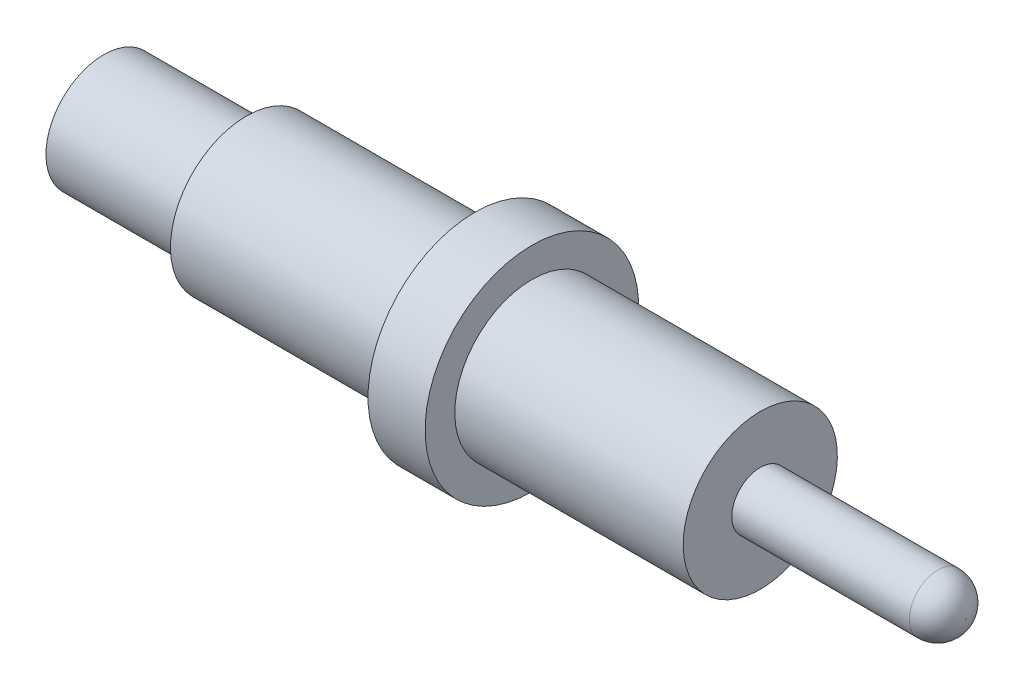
ISO-10303-21;
HEADER;
FILE_DESCRIPTION(('STEP AP214'),'2;1');
FILE_NAME('part.step','',(''),(''),'','','');
FILE_SCHEMA(('AUTOMOTIVE_DESIGN { 1 0 10303 214 1 1 1 1 }'));
ENDSEC;
DATA;
#1=APPLICATION_CONTEXT('core data for automotive mechanical design processes');
#2=APPLICATION_PROTOCOL_DEFINITION('international standard','automotive_design',2000,#1);
#3=PRODUCT_CONTEXT('',#1,'mechanical');
#4=PRODUCT('Part','Part','',(#3));
#5=PRODUCT_RELATED_PRODUCT_CATEGORY('part','',(#4));
#6=PRODUCT_DEFINITION_FORMATION('','',#4);
#7=PRODUCT_DEFINITION_CONTEXT('part definition',#1,'design');
#8=PRODUCT_DEFINITION('design','',#6,#7);
#9=PRODUCT_DEFINITION_SHAPE('','',#8);
#10=(LENGTH_UNIT() NAMED_UNIT(*) SI_UNIT(.MILLI.,.METRE.));
#11=(NAMED_UNIT(*) PLANE_ANGLE_UNIT() SI_UNIT($,.RADIAN.));
#12=(NAMED_UNIT(*) SI_UNIT($,.STERADIAN.) SOLID_ANGLE_UNIT());
#13=UNCERTAINTY_MEASURE_WITH_UNIT(LENGTH_MEASURE(1.E-05),#10,'distance_accuracy_value','');
#14=(GEOMETRIC_REPRESENTATION_CONTEXT(3) GLOBAL_UNCERTAINTY_ASSIGNED_CONTEXT((#13)) GLOBAL_UNIT_ASSIGNED_CONTEXT((#10,
#11,#12)) REPRESENTATION_CONTEXT('',''));
#15=CARTESIAN_POINT('',(0.,0.,0.));
#16=DIRECTION('',(0.,0.,1.));
#17=DIRECTION('',(1.,0.,0.));
#18=AXIS2_PLACEMENT_3D('',#15,#16,#17);
#19=CARTESIAN_POINT('',(-19.177,1.2827,0.));
#20=DIRECTION('',(-1.,0.,0.));
#21=DIRECTION('',(0.,-1.,0.));
#22=AXIS2_PLACEMENT_3D('',#19,#20,#21);
#23=PLANE('',#22);
#24=CARTESIAN_POINT('',(-19.177,0.,0.));
#25=DIRECTION('',(1.,0.,0.));
#26=DIRECTION('',(0.,1.,0.));
#27=AXIS2_PLACEMENT_3D('',#24,#25,#26);
#28=CIRCLE('',#27,1.2827);
#29=CARTESIAN_POINT('',(-19.177,1.2827,0.));
#30=VERTEX_POINT('',#29);
#31=EDGE_CURVE('E66',#30,#30,#28,.T.);
#32=ORIENTED_EDGE('',*,*,#31,.F.);
#33=EDGE_LOOP('',(#32));
#34=FACE_BOUND('',#33,.T.);
#35=ADVANCED_FACE('F29',(#34),#23,.T.);
#36=CARTESIAN_POINT('',(0.,0.0126999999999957,0.));
#37=DIRECTION('',(1.,0.,0.));
#38=DIRECTION('',(0.,1.,0.));
#39=AXIS2_PLACEMENT_3D('',#36,#37,#38);
#40=PLANE('',#39);
#41=CARTESIAN_POINT('',(0.,0.,0.));
#42=DIRECTION('',(1.,0.,0.));
#43=DIRECTION('',(0.,1.,0.));
#44=AXIS2_PLACEMENT_3D('',#41,#42,#43);
#45=CIRCLE('',#44,0.0126999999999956);
#46=CARTESIAN_POINT('',(0.,0.0126999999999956,0.));
#47=VERTEX_POINT('',#46);
#48=EDGE_CURVE('E10',#47,#47,#45,.T.);
#49=ORIENTED_EDGE('',*,*,#48,.T.);
#50=EDGE_LOOP('',(#49));
#51=FACE_BOUND('',#50,.T.);
#52=ADVANCED_FACE('F74',(#51),#40,.T.);
#53=CARTESIAN_POINT('',(-0.6223,0.,0.));
#54=DIRECTION('',(1.,0.,0.));
#55=DIRECTION('',(0.,1.,0.));
#56=AXIS2_PLACEMENT_3D('',#53,#54,#55);
#57=DEGENERATE_TOROIDAL_SURFACE('',#56,0.0127000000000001,0.6223,.T.);
#58=CARTESIAN_POINT('',(-0.622300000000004,0.,0.));
#59=DIRECTION('',(1.,0.,0.));
#60=DIRECTION('',(0.,1.,0.));
#61=AXIS2_PLACEMENT_3D('',#58,#59,#60);
#62=CIRCLE('',#61,0.635);
#63=CARTESIAN_POINT('',(-0.622300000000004,0.635,0.));
#64=VERTEX_POINT('',#63);
#65=EDGE_CURVE('E35',#64,#64,#62,.T.);
#66=ORIENTED_EDGE('',*,*,#65,.T.);
#67=EDGE_LOOP('',(#66));
#68=FACE_BOUND('',#67,.T.);
#69=ORIENTED_EDGE('',*,*,#48,.F.);
#70=EDGE_LOOP('',(#69));
#71=FACE_BOUND('',#70,.T.);
#72=ADVANCED_FACE('F78',(#68,#71),#57,.T.);
#73=CARTESIAN_POINT('',(0.,0.,0.));
#74=DIRECTION('',(1.,0.,0.));
#75=DIRECTION('',(0.,1.,0.));
#76=AXIS2_PLACEMENT_3D('',#73,#74,#75);
#77=CYLINDRICAL_SURFACE('',#76,0.635);
#78=CARTESIAN_POINT('',(-4.572,0.,0.));
#79=DIRECTION('',(1.,0.,0.));
#80=DIRECTION('',(0.,1.,0.));
#81=AXIS2_PLACEMENT_3D('',#78,#79,#80);
#82=CIRCLE('',#81,0.635000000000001);
#83=CARTESIAN_POINT('',(-4.572,0.635,0.));
#84=VERTEX_POINT('',#83);
#85=EDGE_CURVE('E39',#84,#84,#82,.T.);
#86=ORIENTED_EDGE('',*,*,#85,.T.);
#87=EDGE_LOOP('',(#86));
#88=FACE_BOUND('',#87,.T.);
#89=ORIENTED_EDGE('',*,*,#65,.F.);
#90=EDGE_LOOP('',(#89));
#91=FACE_BOUND('',#90,.T.);
#92=ADVANCED_FACE('F82',(#88,#91),#77,.T.);
#93=CARTESIAN_POINT('',(-4.572,1.7145,0.));
#94=DIRECTION('',(1.,0.,0.));
#95=DIRECTION('',(0.,1.,0.));
#96=AXIS2_PLACEMENT_3D('',#93,#94,#95);
#97=PLANE('',#96);
#98=CARTESIAN_POINT('',(-4.572,0.,0.));
#99=DIRECTION('',(1.,0.,0.));
#100=DIRECTION('',(0.,1.,0.));
#101=AXIS2_PLACEMENT_3D('',#98,#99,#100);
#102=CIRCLE('',#101,1.7145);
#103=CARTESIAN_POINT('',(-4.572,1.7145,0.));
#104=VERTEX_POINT('',#103);
#105=EDGE_CURVE('E43',#104,#104,#102,.T.);
#106=ORIENTED_EDGE('',*,*,#105,.T.);
#107=EDGE_LOOP('',(#106));
#108=FACE_BOUND('',#107,.T.);
#109=ORIENTED_EDGE('',*,*,#85,.F.);
#110=EDGE_LOOP('',(#109));
#111=FACE_BOUND('',#110,.T.);
#112=ADVANCED_FACE('F87',(#108,#111),#97,.T.);
#113=CARTESIAN_POINT('',(0.,0.,0.));
#114=DIRECTION('',(1.,0.,0.));
#115=DIRECTION('',(0.,1.,0.));
#116=AXIS2_PLACEMENT_3D('',#113,#114,#115);
#117=CYLINDRICAL_SURFACE('',#116,1.7145);
#118=CARTESIAN_POINT('',(-9.652,0.,0.));
#119=DIRECTION('',(1.,0.,0.));
#120=DIRECTION('',(0.,1.,0.));
#121=AXIS2_PLACEMENT_3D('',#118,#119,#120);
#122=CIRCLE('',#121,1.7145);
#123=CARTESIAN_POINT('',(-9.652,1.7145,0.));
#124=VERTEX_POINT('',#123);
#125=EDGE_CURVE('E48',#124,#124,#122,.T.);
#126=ORIENTED_EDGE('',*,*,#125,.T.);
#127=EDGE_LOOP('',(#126));
#128=FACE_BOUND('',#127,.T.);
#129=ORIENTED_EDGE('',*,*,#105,.F.);
#130=EDGE_LOOP('',(#129));
#131=FACE_BOUND('',#130,.T.);
#132=ADVANCED_FACE('F91',(#128,#131),#117,.T.);
#133=CARTESIAN_POINT('',(-9.652,2.3749,0.));
#134=DIRECTION('',(1.,0.,0.));
#135=DIRECTION('',(0.,1.,0.));
#136=AXIS2_PLACEMENT_3D('',#133,#134,#135);
#137=PLANE('',#136);
#138=CARTESIAN_POINT('',(-9.652,0.,0.));
#139=DIRECTION('',(1.,0.,0.));
#140=DIRECTION('',(0.,1.,0.));
#141=AXIS2_PLACEMENT_3D('',#138,#139,#140);
#142=CIRCLE('',#141,2.3749);
#143=CARTESIAN_POINT('',(-9.652,2.3749,0.));
#144=VERTEX_POINT('',#143);
#145=EDGE_CURVE('E51',#144,#144,#142,.T.);
#146=ORIENTED_EDGE('',*,*,#145,.T.);
#147=EDGE_LOOP('',(#146));
#148=FACE_BOUND('',#147,.T.);
#149=ORIENTED_EDGE('',*,*,#125,.F.);
#150=EDGE_LOOP('',(#149));
#151=FACE_BOUND('',#150,.T.);
#152=ADVANCED_FACE('F95',(#148,#151),#137,.T.);
#153=CARTESIAN_POINT('',(0.,0.,0.));
#154=DIRECTION('',(1.,0.,0.));
#155=DIRECTION('',(0.,1.,0.));
#156=AXIS2_PLACEMENT_3D('',#153,#154,#155);
#157=CYLINDRICAL_SURFACE('',#156,2.3749);
#158=CARTESIAN_POINT('',(-10.922,0.,0.));
#159=DIRECTION('',(1.,0.,0.));
#160=DIRECTION('',(0.,1.,0.));
#161=AXIS2_PLACEMENT_3D('',#158,#159,#160);
#162=CIRCLE('',#161,2.3749);
#163=CARTESIAN_POINT('',(-10.922,2.3749,0.));
#164=VERTEX_POINT('',#163);
#165=EDGE_CURVE('E54',#164,#164,#162,.T.);
#166=ORIENTED_EDGE('',*,*,#165,.T.);
#167=EDGE_LOOP('',(#166));
#168=FACE_BOUND('',#167,.T.);
#169=ORIENTED_EDGE('',*,*,#145,.F.);
#170=EDGE_LOOP('',(#169));
#171=FACE_BOUND('',#170,.T.);
#172=ADVANCED_FACE('F99',(#168,#171),#157,.T.);
#173=CARTESIAN_POINT('',(-10.922,1.6891,0.));
#174=DIRECTION('',(-1.,0.,0.));
#175=DIRECTION('',(0.,-1.,0.));
#176=AXIS2_PLACEMENT_3D('',#173,#174,#175);
#177=PLANE('',#176);
#178=CARTESIAN_POINT('',(-10.922,0.,0.));
#179=DIRECTION('',(1.,0.,0.));
#180=DIRECTION('',(0.,1.,0.));
#181=AXIS2_PLACEMENT_3D('',#178,#179,#180);
#182=CIRCLE('',#181,1.6891);
#183=CARTESIAN_POINT('',(-10.922,1.6891,0.));
#184=VERTEX_POINT('',#183);
#185=EDGE_CURVE('E57',#184,#184,#182,.T.);
#186=ORIENTED_EDGE('',*,*,#185,.T.);
#187=EDGE_LOOP('',(#186));
#188=FACE_BOUND('',#187,.T.);
#189=ORIENTED_EDGE('',*,*,#165,.F.);
#190=EDGE_LOOP('',(#189));
#191=FACE_BOUND('',#190,.T.);
#192=ADVANCED_FACE('F103',(#188,#191),#177,.T.);
#193=CARTESIAN_POINT('',(0.,0.,0.));
#194=DIRECTION('',(1.,0.,0.));
#195=DIRECTION('',(0.,1.,0.));
#196=AXIS2_PLACEMENT_3D('',#193,#194,#195);
#197=CYLINDRICAL_SURFACE('',#196,1.6891);
#198=CARTESIAN_POINT('',(-16.002,0.,0.));
#199=DIRECTION('',(1.,0.,0.));
#200=DIRECTION('',(0.,1.,0.));
#201=AXIS2_PLACEMENT_3D('',#198,#199,#200);
#202=CIRCLE('',#201,1.6891);
#203=CARTESIAN_POINT('',(-16.002,1.6891,0.));
#204=VERTEX_POINT('',#203);
#205=EDGE_CURVE('E60',#204,#204,#202,.T.);
#206=ORIENTED_EDGE('',*,*,#205,.T.);
#207=EDGE_LOOP('',(#206));
#208=FACE_BOUND('',#207,.T.);
#209=ORIENTED_EDGE('',*,*,#185,.F.);
#210=EDGE_LOOP('',(#209));
#211=FACE_BOUND('',#210,.T.);
#212=ADVANCED_FACE('F107',(#208,#211),#197,.T.);
#213=CARTESIAN_POINT('',(-16.002,1.2827,0.));
#214=DIRECTION('',(-1.,0.,0.));
#215=DIRECTION('',(0.,-1.,0.));
#216=AXIS2_PLACEMENT_3D('',#213,#214,#215);
#217=PLANE('',#216);
#218=CARTESIAN_POINT('',(-16.002,0.,0.));
#219=DIRECTION('',(1.,0.,0.));
#220=DIRECTION('',(0.,1.,0.));
#221=AXIS2_PLACEMENT_3D('',#218,#219,#220);
#222=CIRCLE('',#221,1.2827);
#223=CARTESIAN_POINT('',(-16.002,1.2827,0.));
#224=VERTEX_POINT('',#223);
#225=EDGE_CURVE('E63',#224,#224,#222,.T.);
#226=ORIENTED_EDGE('',*,*,#225,.T.);
#227=EDGE_LOOP('',(#226));
#228=FACE_BOUND('',#227,.T.);
#229=ORIENTED_EDGE('',*,*,#205,.F.);
#230=EDGE_LOOP('',(#229));
#231=FACE_BOUND('',#230,.T.);
#232=ADVANCED_FACE('F111',(#228,#231),#217,.T.);
#233=CARTESIAN_POINT('',(0.,0.,0.));
#234=DIRECTION('',(1.,0.,0.));
#235=DIRECTION('',(0.,1.,0.));
#236=AXIS2_PLACEMENT_3D('',#233,#234,#235);
#237=CYLINDRICAL_SURFACE('',#236,1.2827);
#238=ORIENTED_EDGE('',*,*,#31,.T.);
#239=EDGE_LOOP('',(#238));
#240=FACE_BOUND('',#239,.T.);
#241=ORIENTED_EDGE('',*,*,#225,.F.);
#242=EDGE_LOOP('',(#241));
#243=FACE_BOUND('',#242,.T.);
#244=ADVANCED_FACE('F70',(#240,#243),#237,.T.);
#245=CLOSED_SHELL('',(#35,#52,#72,#92,#112,#132,#152,#172,#192,#212,#232,#244));
#246=MANIFOLD_SOLID_BREP('B2',#245);
#247=ADVANCED_BREP_SHAPE_REPRESENTATION('',(#18,#246),#14);
#248=SHAPE_DEFINITION_REPRESENTATION(#9,#247);
ENDSEC;
END-ISO-10303-21;
